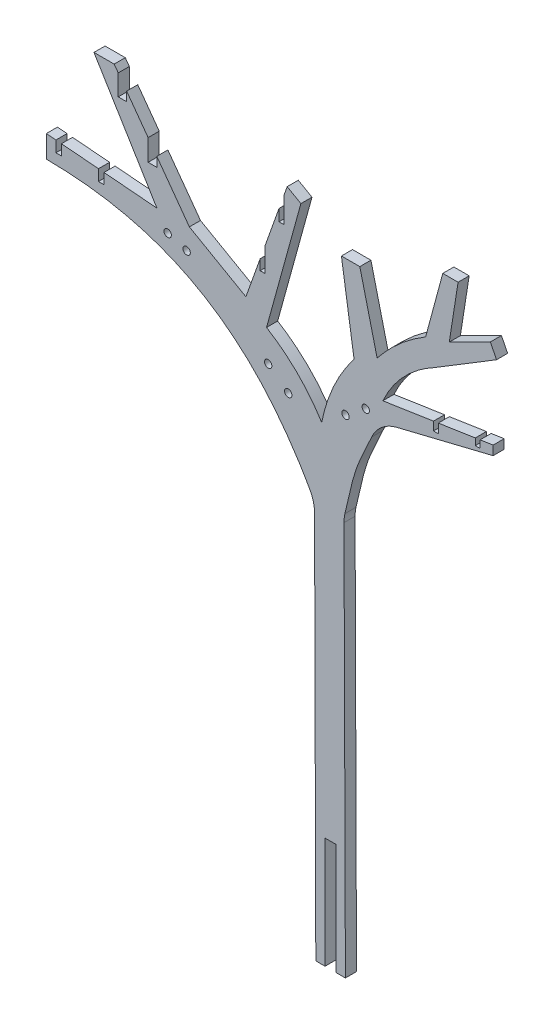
from build123d import *

# Parameters (mm, degrees)
BOSS_EXTRU_1_DEPTH      = 3
ESQUISSE2_R             = 1
ESQUISSE2_W             = 1.5
ESQUISSE2_H             = 3
ESQUISSE2_W_2           = 1.3
ESQUISSE2_H_2           = 2
ESQUISSE2_H_3           = 2.5
ESQUISSE2_H_4           = 6.790249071
ESQUISSE2_H_5           = 6.456046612
ESQUISSE2_W_3           = 2.272675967
ESQUISSE2_H_6           = 5.611187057
ESQUISSE2_W_4           = 2.338764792
ESQUISSE2_H_7           = 5.782769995
ENL_V_MAT_EXTRU_1_DEPTH = 3
ESQUISSE3_W             = 3
ESQUISSE3_H             = 30
ENL_V_MAT_EXTRU_2_DEPTH = 10


with BuildPart() as part:
    # Esquisse1 → Boss.-Extru.1 (new body)
    with BuildSketch(Plane.XY):
        with BuildLine():
            Line((2.516635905, 61.049964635), (2.17752481, 165.743470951))
            ThreePointArc((2.17752481, 165.743470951), (1.862948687, 168.187999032), (0.954541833, 170.479171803))
            add(Edge.make_bspline(
                [(0.954541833, 170.479171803), (-1.228394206, 174.454080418), (-17.892658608, 200.296518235), (-42.150144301, 212.093393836), (-70.300056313, 212.278545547)],
                knots=[0.022769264, 0.022769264, 0.022769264, 0.022769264, 0.195051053, 1, 1, 1, 1], degree=3))
            Line((-70.300056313, 212.278545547), (-70.300056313, 218.278545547))
            Line((-70.300056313, 218.278545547), (-40.416650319, 215.753973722))
            Line((-40.416650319, 215.753973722), (-57.432843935, 243.694191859))
            Line((-57.432843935, 243.694191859), (-51.970330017, 243.694191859))
            Line((-51.970330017, 243.694191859), (-31.645747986, 215.753973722))
            Line((-31.645747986, 215.753973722), (-16.377848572, 207.037706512))
            Line((-16.377848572, 207.037706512), (-5.21729031, 238.389396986))
            Line((-5.21729031, 238.389396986), (-1.510608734, 236.273911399))
            Line((-1.510608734, 236.273911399), (-10.79369782, 202.642361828))
            add(Edge.make_bspline(
                [(-10.79369782, 202.642361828), (-1.60539159, 197.009587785), (4.108630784, 187.873582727)],
                knots=[0, 0, 0, 1, 1, 1], degree=2))
            add(Edge.make_bspline(
                [(4.108630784, 187.873582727), (6.238182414, 198.495541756), (12.853772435, 207.037706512)],
                knots=[0, 0, 0, 1, 1, 1], degree=2))
            Line((12.853772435, 207.037706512), (9.439234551, 229.491603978))
            Line((9.439234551, 229.491603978), (14.412896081, 229.491603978))
            Line((14.412896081, 229.491603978), (19.091860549, 210.408407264))
            add(Edge.make_bspline(
                [(19.091860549, 210.408407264), (24.601810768, 217.389360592), (32.197853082, 221.927217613)],
                knots=[0, 0, 0, 1, 1, 1], degree=2))
            Line((32.197853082, 221.927217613), (36.832861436, 239.113723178))
            Line((36.832861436, 239.113723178), (40.962288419, 239.113723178))
            Line((40.962288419, 239.113723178), (38.586051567, 223.90477713))
            add(Edge.make_bspline(
                [(38.586051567, 223.90477713), (44.135550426, 226.698190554), (49.685049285, 229.491603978)],
                knots=[0, 0, 0, 1, 1, 1], degree=2))
            Line((49.685049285, 229.491603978), (51.362220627, 226.159673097))
            Line((51.362220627, 226.159673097), (34.561266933, 215.927531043))
            add(Edge.make_bspline(
                [(34.561266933, 215.927531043), (24.996176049, 210.756152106), (20.634328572, 201.197896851)],
                knots=[0, 0, 0, 1, 1, 1], degree=2))
            Line((20.634328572, 201.197896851), (50.431126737, 205.729061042))
            Line((50.431126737, 205.729061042), (50.431126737, 203.242114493))
            Line((50.431126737, 203.242114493), (24.364193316, 196.85082392))
            ThreePointArc((24.364193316, 196.85082392), (20.333256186, 194.812006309), (17.610759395, 191.207392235))
            add(Edge.make_bspline(
                [(17.610759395, 191.207392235), (16.095725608, 187.806098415), (13.315354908, 182.026541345), (12.360627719, 178.495380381), (10.374906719, 169.652516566)],
                knots=[0.094315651, 0.094315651, 0.094315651, 0.094315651, 0.397347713, 0.983634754, 0.983634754, 0.983634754, 0.983634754], degree=3))
            ThreePointArc((10.374906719, 169.652516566), (10.190883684, 168.545760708), (10.131995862, 167.42535666))
            Line((10.131995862, 167.42535666), (10.516635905, 61.049964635))
            Line((10.516635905, 61.049964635), (2.516635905, 61.049964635))
        make_face()
    extrude(amount=BOSS_EXTRU_1_DEPTH)

    # Esquisse2 → Enl_v. mat.-Extru.1 (cut)
    with BuildSketch(Plane.XY.offset(3)):
        with Locations((-37.516478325, 211.356141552)):
            Circle(ESQUISSE2_R)
        with Locations((-32.389949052, 209.813646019)):
            Circle(ESQUISSE2_R)
        with Locations((-10.352517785, 194.350574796)):
            Circle(ESQUISSE2_R)
        with Locations((-4.932356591, 190.198650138)):
            Circle(ESQUISSE2_R)
        with Locations((10.53493267, 192.842631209)):
            Circle(ESQUISSE2_R)
        with Locations((16.011958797, 197.009777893)):
            Circle(ESQUISSE2_R)
        with Locations((-66.966166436, 216.560256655)):
            Rectangle(ESQUISSE2_W, ESQUISSE2_H)
        with Locations((-55.466166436, 215.588728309)):
            Rectangle(ESQUISSE2_W, ESQUISSE2_H)
        with Locations((46.26336533, 204.194119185)):
            Rectangle(ESQUISSE2_W_2, ESQUISSE2_H_2)
        with Locations((34.96336533, 202.225741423)):
            Rectangle(ESQUISSE2_W_2, ESQUISSE2_H_3)
        with Locations((-6.772916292, 232.450232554)):
            Rectangle(ESQUISSE2_W_2, ESQUISSE2_H_4)
        with Locations((-11.873765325, 218.288279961)):
            Rectangle(ESQUISSE2_W_2, ESQUISSE2_H_5)
        with Locations((-49.733700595, 239.376026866)):
            Rectangle(ESQUISSE2_W_3, ESQUISSE2_H_6)
        with Locations((-41.62417837, 228.1874953)):
            Rectangle(ESQUISSE2_W_4, ESQUISSE2_H_7)
    extrude(amount=-ENL_V_MAT_EXTRU_1_DEPTH, mode=Mode.SUBTRACT)

    # Esquisse3 → Enl_v. mat.-Extru.2 (cut)
    with BuildSketch(Plane.XY.offset(3)):
        with Locations((6.516635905, 76.049964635)):
            Rectangle(ESQUISSE3_W, ESQUISSE3_H)
    extrude(amount=-ENL_V_MAT_EXTRU_2_DEPTH, mode=Mode.SUBTRACT)


solid = part.part
